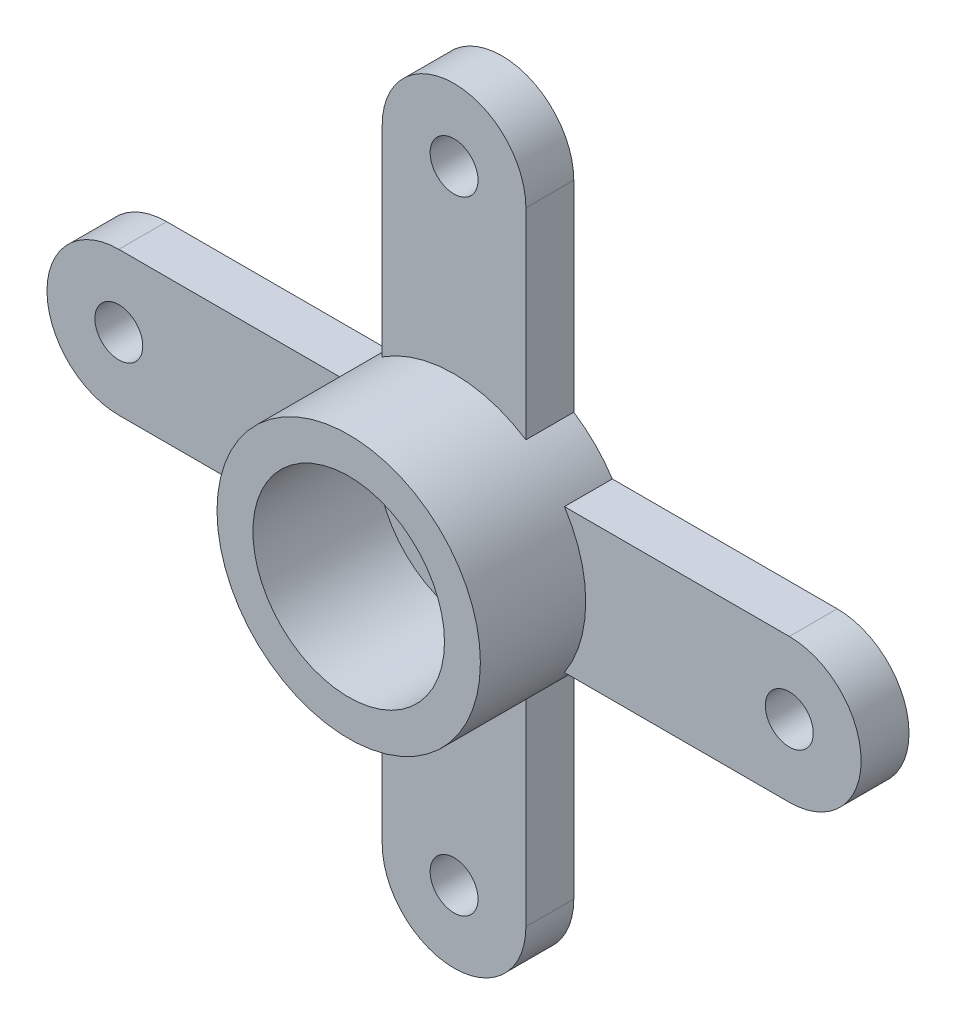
from build123d import *

# Parameters (mm, degrees)
ESQUISSE1_R                  = 0.5
EXTRUSION1_DEPTH             = 1
ESQUISSE3_R                  = 2.75
EXTRUSION3_DEPTH             = 2.2
EXTRUSION3_DIRECTION_2_REACH = 13.715
ESQUISSE4_R                  = 2
EXTRUSION4_DEPTH             = 2.6


with BuildPart() as part:
    # Esquisse1 → Extrusion1 (new body)
    with BuildSketch(Plane.XY):
        with BuildLine():
            Line((-7, 1.5), (-1.5, 1.5))
            Line((-1.5, 1.5), (-1.5, 6.5))
            ThreePointArc((-1.5, 6.5), (0, 8), (1.5, 6.5))
            Line((1.5, 6.5), (1.5, 1.5))
            Line((1.5, 1.5), (7, 1.5))
            ThreePointArc((7, 1.5), (8.5, 0), (7, -1.5))
            Line((7, -1.5), (1.5, -1.5))
            Line((1.5, -1.5), (1.5, -6.5))
            ThreePointArc((1.5, -6.5), (0, -8), (-1.5, -6.5))
            Line((-1.5, -6.5), (-1.5, -1.5))
            Line((-1.5, -1.5), (-7, -1.5))
            ThreePointArc((-7, -1.5), (-8.5, 0), (-7, 1.5))
        make_face()
        with Locations((0, 6.5)):
            Circle(ESQUISSE1_R, mode=Mode.SUBTRACT)
        with Locations((-7, 0)):
            Circle(ESQUISSE1_R, mode=Mode.SUBTRACT)
        with Locations((7, 0)):
            Circle(ESQUISSE1_R, mode=Mode.SUBTRACT)
        with Locations((0, -6.5)):
            Circle(ESQUISSE1_R, mode=Mode.SUBTRACT)
    extrude(amount=EXTRUSION1_DEPTH)

    # Esquisse3 → Extrusion3 (add)
    with BuildSketch(Plane.XY.offset(1)):
        Circle(ESQUISSE3_R)
    extrude(amount=EXTRUSION3_DEPTH)

    # Extrusion3 direction 2: up to this face of the body (flat: up to its plane)
    extrusion3_direction_2_end = Plane(part.part.faces().sort_by_distance((0, 0, 0))[0])
    # Esquisse3 → Extrusion3 direction 2 (add, up to the picked face)
    with BuildSketch(Plane.XY.offset(1), mode=Mode.PRIVATE) as extrusion3_direction_2_sk1:
        Circle(ESQUISSE3_R)
    extrusion3_direction_2_tool1 = split(extrude(extrusion3_direction_2_sk1.sketch, amount=-EXTRUSION3_DIRECTION_2_REACH, mode=Mode.PRIVATE), bisect_by=extrusion3_direction_2_end, keep=Keep.BOTH, mode=Mode.PRIVATE)
    add(extrusion3_direction_2_tool1.solids().sort_by(Axis((0, 0, 1), (0, 0, -1)))[0])

    # Esquisse4 → Extrusion4 (cut)
    with BuildSketch(Plane.XY.offset(3.2)):
        Circle(ESQUISSE4_R)
    extrude(amount=-EXTRUSION4_DEPTH, mode=Mode.SUBTRACT)


solid = part.part
